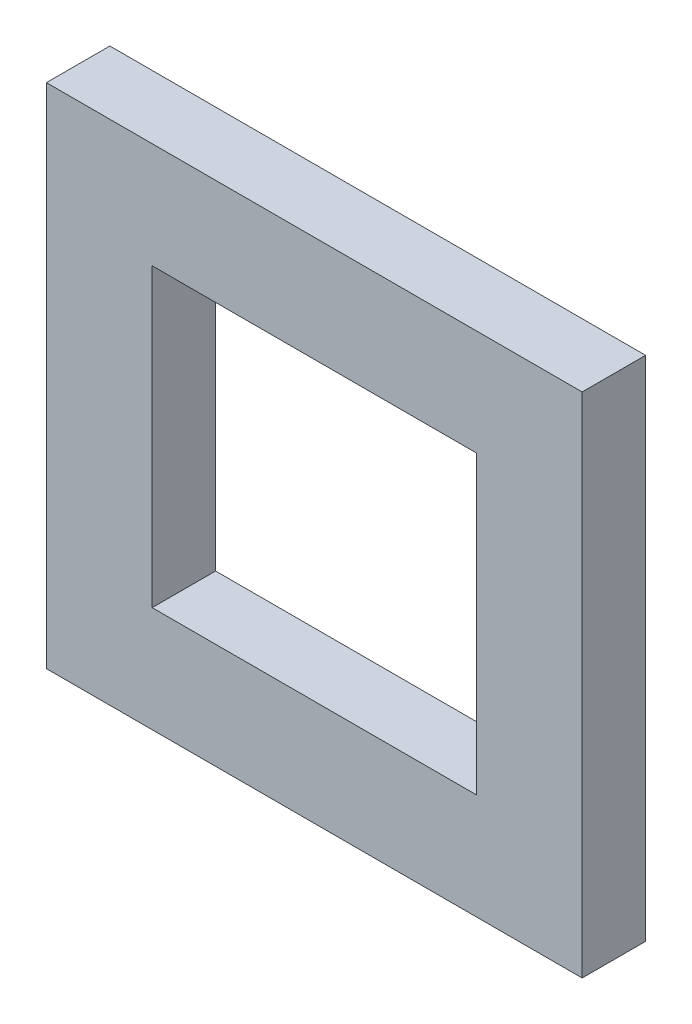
ISO-10303-21;
HEADER;
FILE_DESCRIPTION(('STEP AP214'),'2;1');
FILE_NAME('part.step','',(''),(''),'','','');
FILE_SCHEMA(('AUTOMOTIVE_DESIGN { 1 0 10303 214 1 1 1 1 }'));
ENDSEC;
DATA;
#1=APPLICATION_CONTEXT('core data for automotive mechanical design processes');
#2=APPLICATION_PROTOCOL_DEFINITION('international standard','automotive_design',2000,#1);
#3=PRODUCT_CONTEXT('',#1,'mechanical');
#4=PRODUCT('Part','Part','',(#3));
#5=PRODUCT_RELATED_PRODUCT_CATEGORY('part','',(#4));
#6=PRODUCT_DEFINITION_FORMATION('','',#4);
#7=PRODUCT_DEFINITION_CONTEXT('part definition',#1,'design');
#8=PRODUCT_DEFINITION('design','',#6,#7);
#9=PRODUCT_DEFINITION_SHAPE('','',#8);
#10=(LENGTH_UNIT() NAMED_UNIT(*) SI_UNIT(.MILLI.,.METRE.));
#11=(NAMED_UNIT(*) PLANE_ANGLE_UNIT() SI_UNIT($,.RADIAN.));
#12=(NAMED_UNIT(*) SI_UNIT($,.STERADIAN.) SOLID_ANGLE_UNIT());
#13=UNCERTAINTY_MEASURE_WITH_UNIT(LENGTH_MEASURE(1.E-05),#10,'distance_accuracy_value','');
#14=(GEOMETRIC_REPRESENTATION_CONTEXT(3) GLOBAL_UNCERTAINTY_ASSIGNED_CONTEXT((#13)) GLOBAL_UNIT_ASSIGNED_CONTEXT((#10,
#11,#12)) REPRESENTATION_CONTEXT('',''));
#15=CARTESIAN_POINT('',(0.,0.,0.));
#16=DIRECTION('',(0.,0.,1.));
#17=DIRECTION('',(1.,0.,0.));
#18=AXIS2_PLACEMENT_3D('',#15,#16,#17);
#19=CARTESIAN_POINT('',(0.,0.,28.575));
#20=DIRECTION('',(0.,0.,1.));
#21=DIRECTION('',(1.,0.,0.));
#22=AXIS2_PLACEMENT_3D('',#19,#20,#21);
#23=PLANE('',#22);
#24=DIRECTION('',(0.,-1.,0.));
#25=VECTOR('',#24,1.);
#26=CARTESIAN_POINT('',(-120.65,114.3,28.575));
#27=LINE('',#26,#25);
#28=CARTESIAN_POINT('',(-120.65,114.3,28.575));
#29=VERTEX_POINT('',#28);
#30=CARTESIAN_POINT('',(-120.65,-114.3,28.575));
#31=VERTEX_POINT('',#30);
#32=EDGE_CURVE('E137',#29,#31,#27,.T.);
#33=ORIENTED_EDGE('',*,*,#32,.T.);
#34=DIRECTION('',(1.,0.,0.));
#35=VECTOR('',#34,1.);
#36=CARTESIAN_POINT('',(-120.65,-114.3,28.575));
#37=LINE('',#36,#35);
#38=CARTESIAN_POINT('',(120.65,-114.3,28.575));
#39=VERTEX_POINT('',#38);
#40=EDGE_CURVE('E140',#31,#39,#37,.T.);
#41=ORIENTED_EDGE('',*,*,#40,.T.);
#42=DIRECTION('',(0.,1.,0.));
#43=VECTOR('',#42,1.);
#44=CARTESIAN_POINT('',(120.65,114.3,28.575));
#45=LINE('',#44,#43);
#46=CARTESIAN_POINT('',(120.65,114.3,28.575));
#47=VERTEX_POINT('',#46);
#48=EDGE_CURVE('E143',#39,#47,#45,.T.);
#49=ORIENTED_EDGE('',*,*,#48,.T.);
#50=DIRECTION('',(-1.,0.,0.));
#51=VECTOR('',#50,1.);
#52=CARTESIAN_POINT('',(-120.65,114.3,28.575));
#53=LINE('',#52,#51);
#54=EDGE_CURVE('E145',#47,#29,#53,.T.);
#55=ORIENTED_EDGE('',*,*,#54,.T.);
#56=EDGE_LOOP('',(#33,#41,#49,#55));
#57=FACE_BOUND('',#56,.T.);
#58=DIRECTION('',(0.,-1.,0.));
#59=VECTOR('',#58,1.);
#60=CARTESIAN_POINT('',(-73.025,66.675,28.575));
#61=LINE('',#60,#59);
#62=CARTESIAN_POINT('',(-73.025,66.675,28.575));
#63=VERTEX_POINT('',#62);
#64=CARTESIAN_POINT('',(-73.025,-66.675,28.575));
#65=VERTEX_POINT('',#64);
#66=EDGE_CURVE('E109',#63,#65,#61,.T.);
#67=ORIENTED_EDGE('',*,*,#66,.F.);
#68=DIRECTION('',(-1.,0.,0.));
#69=VECTOR('',#68,1.);
#70=CARTESIAN_POINT('',(-73.025,66.675,28.575));
#71=LINE('',#70,#69);
#72=CARTESIAN_POINT('',(73.025,66.675,28.575));
#73=VERTEX_POINT('',#72);
#74=EDGE_CURVE('E101',#73,#63,#71,.T.);
#75=ORIENTED_EDGE('',*,*,#74,.F.);
#76=DIRECTION('',(0.,1.,0.));
#77=VECTOR('',#76,1.);
#78=CARTESIAN_POINT('',(73.025,66.675,28.575));
#79=LINE('',#78,#77);
#80=CARTESIAN_POINT('',(73.025,-66.675,28.575));
#81=VERTEX_POINT('',#80);
#82=EDGE_CURVE('E123',#81,#73,#79,.T.);
#83=ORIENTED_EDGE('',*,*,#82,.F.);
#84=DIRECTION('',(1.,0.,0.));
#85=VECTOR('',#84,1.);
#86=CARTESIAN_POINT('',(-73.025,-66.675,28.575));
#87=LINE('',#86,#85);
#88=EDGE_CURVE('E121',#65,#81,#87,.T.);
#89=ORIENTED_EDGE('',*,*,#88,.F.);
#90=EDGE_LOOP('',(#67,#75,#83,#89));
#91=FACE_BOUND('',#90,.T.);
#92=ADVANCED_FACE('F36',(#57,#91),#23,.T.);
#93=CARTESIAN_POINT('',(0.,0.,0.));
#94=DIRECTION('',(0.,0.,1.));
#95=DIRECTION('',(1.,0.,0.));
#96=AXIS2_PLACEMENT_3D('',#93,#94,#95);
#97=PLANE('',#96);
#98=DIRECTION('',(0.,-1.,0.));
#99=VECTOR('',#98,1.);
#100=CARTESIAN_POINT('',(-120.65,114.3,0.));
#101=LINE('',#100,#99);
#102=CARTESIAN_POINT('',(-120.65,114.3,0.));
#103=VERTEX_POINT('',#102);
#104=CARTESIAN_POINT('',(-120.65,-114.3,0.));
#105=VERTEX_POINT('',#104);
#106=EDGE_CURVE('E117',#103,#105,#101,.T.);
#107=ORIENTED_EDGE('',*,*,#106,.F.);
#108=DIRECTION('',(-1.,0.,0.));
#109=VECTOR('',#108,1.);
#110=CARTESIAN_POINT('',(-120.65,114.3,0.));
#111=LINE('',#110,#109);
#112=CARTESIAN_POINT('',(120.65,114.3,0.));
#113=VERTEX_POINT('',#112);
#114=EDGE_CURVE('E141',#113,#103,#111,.T.);
#115=ORIENTED_EDGE('',*,*,#114,.F.);
#116=DIRECTION('',(0.,1.,0.));
#117=VECTOR('',#116,1.);
#118=CARTESIAN_POINT('',(120.65,114.3,0.));
#119=LINE('',#118,#117);
#120=CARTESIAN_POINT('',(120.65,-114.3,0.));
#121=VERTEX_POINT('',#120);
#122=EDGE_CURVE('E152',#121,#113,#119,.T.);
#123=ORIENTED_EDGE('',*,*,#122,.F.);
#124=DIRECTION('',(1.,0.,0.));
#125=VECTOR('',#124,1.);
#126=CARTESIAN_POINT('',(-120.65,-114.3,0.));
#127=LINE('',#126,#125);
#128=EDGE_CURVE('E150',#105,#121,#127,.T.);
#129=ORIENTED_EDGE('',*,*,#128,.F.);
#130=EDGE_LOOP('',(#107,#115,#123,#129));
#131=FACE_BOUND('',#130,.T.);
#132=DIRECTION('',(-1.,0.,0.));
#133=VECTOR('',#132,1.);
#134=CARTESIAN_POINT('',(-73.025,66.675,0.));
#135=LINE('',#134,#133);
#136=CARTESIAN_POINT('',(73.025,66.675,0.));
#137=VERTEX_POINT('',#136);
#138=CARTESIAN_POINT('',(-73.025,66.675,0.));
#139=VERTEX_POINT('',#138);
#140=EDGE_CURVE('E59',#137,#139,#135,.T.);
#141=ORIENTED_EDGE('',*,*,#140,.T.);
#142=DIRECTION('',(0.,-1.,0.));
#143=VECTOR('',#142,1.);
#144=CARTESIAN_POINT('',(-73.025,66.675,0.));
#145=LINE('',#144,#143);
#146=CARTESIAN_POINT('',(-73.025,-66.675,0.));
#147=VERTEX_POINT('',#146);
#148=EDGE_CURVE('E116',#139,#147,#145,.T.);
#149=ORIENTED_EDGE('',*,*,#148,.T.);
#150=DIRECTION('',(1.,0.,0.));
#151=VECTOR('',#150,1.);
#152=CARTESIAN_POINT('',(-73.025,-66.675,0.));
#153=LINE('',#152,#151);
#154=CARTESIAN_POINT('',(73.025,-66.675,0.));
#155=VERTEX_POINT('',#154);
#156=EDGE_CURVE('E129',#147,#155,#153,.T.);
#157=ORIENTED_EDGE('',*,*,#156,.T.);
#158=DIRECTION('',(0.,1.,0.));
#159=VECTOR('',#158,1.);
#160=CARTESIAN_POINT('',(73.025,66.675,0.));
#161=LINE('',#160,#159);
#162=EDGE_CURVE('E110',#155,#137,#161,.T.);
#163=ORIENTED_EDGE('',*,*,#162,.T.);
#164=EDGE_LOOP('',(#141,#149,#157,#163));
#165=FACE_BOUND('',#164,.T.);
#166=ADVANCED_FACE('F170',(#131,#165),#97,.F.);
#167=CARTESIAN_POINT('',(-120.65,114.3,28.575));
#168=DIRECTION('',(1.,0.,0.));
#169=DIRECTION('',(0.,1.,0.));
#170=AXIS2_PLACEMENT_3D('',#167,#168,#169);
#171=PLANE('',#170);
#172=ORIENTED_EDGE('',*,*,#106,.T.);
#173=DIRECTION('',(0.,0.,-1.));
#174=VECTOR('',#173,1.);
#175=CARTESIAN_POINT('',(-120.65,-114.3,28.575));
#176=LINE('',#175,#174);
#177=EDGE_CURVE('E11',#31,#105,#176,.T.);
#178=ORIENTED_EDGE('',*,*,#177,.F.);
#179=ORIENTED_EDGE('',*,*,#32,.F.);
#180=DIRECTION('',(0.,0.,-1.));
#181=VECTOR('',#180,1.);
#182=CARTESIAN_POINT('',(-120.65,114.3,28.575));
#183=LINE('',#182,#181);
#184=EDGE_CURVE('E147',#29,#103,#183,.T.);
#185=ORIENTED_EDGE('',*,*,#184,.T.);
#186=EDGE_LOOP('',(#172,#178,#179,#185));
#187=FACE_BOUND('',#186,.T.);
#188=ADVANCED_FACE('F38',(#187),#171,.F.);
#189=CARTESIAN_POINT('',(-120.65,-114.3,28.575));
#190=DIRECTION('',(0.,1.,0.));
#191=DIRECTION('',(0.,0.,1.));
#192=AXIS2_PLACEMENT_3D('',#189,#190,#191);
#193=PLANE('',#192);
#194=ORIENTED_EDGE('',*,*,#128,.T.);
#195=DIRECTION('',(0.,0.,-1.));
#196=VECTOR('',#195,1.);
#197=CARTESIAN_POINT('',(120.65,-114.3,28.575));
#198=LINE('',#197,#196);
#199=EDGE_CURVE('E44',#39,#121,#198,.T.);
#200=ORIENTED_EDGE('',*,*,#199,.F.);
#201=ORIENTED_EDGE('',*,*,#40,.F.);
#202=ORIENTED_EDGE('',*,*,#177,.T.);
#203=EDGE_LOOP('',(#194,#200,#201,#202));
#204=FACE_BOUND('',#203,.T.);
#205=ADVANCED_FACE('F180',(#204),#193,.F.);
#206=CARTESIAN_POINT('',(120.65,114.3,28.575));
#207=DIRECTION('',(-1.,0.,0.));
#208=DIRECTION('',(0.,-1.,0.));
#209=AXIS2_PLACEMENT_3D('',#206,#207,#208);
#210=PLANE('',#209);
#211=ORIENTED_EDGE('',*,*,#122,.T.);
#212=DIRECTION('',(0.,0.,-1.));
#213=VECTOR('',#212,1.);
#214=CARTESIAN_POINT('',(120.65,114.3,28.575));
#215=LINE('',#214,#213);
#216=EDGE_CURVE('E157',#47,#113,#215,.T.);
#217=ORIENTED_EDGE('',*,*,#216,.F.);
#218=ORIENTED_EDGE('',*,*,#48,.F.);
#219=ORIENTED_EDGE('',*,*,#199,.T.);
#220=EDGE_LOOP('',(#211,#217,#218,#219));
#221=FACE_BOUND('',#220,.T.);
#222=ADVANCED_FACE('F164',(#221),#210,.F.);
#223=CARTESIAN_POINT('',(-120.65,114.3,28.575));
#224=DIRECTION('',(0.,-1.,0.));
#225=DIRECTION('',(0.,0.,-1.));
#226=AXIS2_PLACEMENT_3D('',#223,#224,#225);
#227=PLANE('',#226);
#228=ORIENTED_EDGE('',*,*,#114,.T.);
#229=ORIENTED_EDGE('',*,*,#184,.F.);
#230=ORIENTED_EDGE('',*,*,#54,.F.);
#231=ORIENTED_EDGE('',*,*,#216,.T.);
#232=EDGE_LOOP('',(#228,#229,#230,#231));
#233=FACE_BOUND('',#232,.T.);
#234=ADVANCED_FACE('F174',(#233),#227,.F.);
#235=CARTESIAN_POINT('',(-73.025,66.675,28.575));
#236=DIRECTION('',(0.,-1.,0.));
#237=DIRECTION('',(0.,0.,-1.));
#238=AXIS2_PLACEMENT_3D('',#235,#236,#237);
#239=PLANE('',#238);
#240=ORIENTED_EDGE('',*,*,#140,.F.);
#241=DIRECTION('',(0.,0.,-1.));
#242=VECTOR('',#241,1.);
#243=CARTESIAN_POINT('',(73.025,66.675,28.575));
#244=LINE('',#243,#242);
#245=EDGE_CURVE('E105',#73,#137,#244,.T.);
#246=ORIENTED_EDGE('',*,*,#245,.F.);
#247=ORIENTED_EDGE('',*,*,#74,.T.);
#248=DIRECTION('',(0.,0.,-1.));
#249=VECTOR('',#248,1.);
#250=CARTESIAN_POINT('',(-73.025,66.675,28.575));
#251=LINE('',#250,#249);
#252=EDGE_CURVE('E104',#63,#139,#251,.T.);
#253=ORIENTED_EDGE('',*,*,#252,.T.);
#254=EDGE_LOOP('',(#240,#246,#247,#253));
#255=FACE_BOUND('',#254,.T.);
#256=ADVANCED_FACE('F103',(#255),#239,.T.);
#257=CARTESIAN_POINT('',(-73.025,66.675,28.575));
#258=DIRECTION('',(1.,0.,0.));
#259=DIRECTION('',(0.,0.,-1.));
#260=AXIS2_PLACEMENT_3D('',#257,#258,#259);
#261=PLANE('',#260);
#262=ORIENTED_EDGE('',*,*,#148,.F.);
#263=ORIENTED_EDGE('',*,*,#252,.F.);
#264=ORIENTED_EDGE('',*,*,#66,.T.);
#265=DIRECTION('',(0.,0.,-1.));
#266=VECTOR('',#265,1.);
#267=CARTESIAN_POINT('',(-73.025,-66.675,28.575));
#268=LINE('',#267,#266);
#269=EDGE_CURVE('E118',#65,#147,#268,.T.);
#270=ORIENTED_EDGE('',*,*,#269,.T.);
#271=EDGE_LOOP('',(#262,#263,#264,#270));
#272=FACE_BOUND('',#271,.T.);
#273=ADVANCED_FACE('F113',(#272),#261,.T.);
#274=CARTESIAN_POINT('',(-73.025,-66.675,28.575));
#275=DIRECTION('',(0.,1.,0.));
#276=DIRECTION('',(-1.,0.,0.));
#277=AXIS2_PLACEMENT_3D('',#274,#275,#276);
#278=PLANE('',#277);
#279=ORIENTED_EDGE('',*,*,#156,.F.);
#280=ORIENTED_EDGE('',*,*,#269,.F.);
#281=ORIENTED_EDGE('',*,*,#88,.T.);
#282=DIRECTION('',(0.,0.,-1.));
#283=VECTOR('',#282,1.);
#284=CARTESIAN_POINT('',(73.025,-66.675,28.575));
#285=LINE('',#284,#283);
#286=EDGE_CURVE('E51',#81,#155,#285,.T.);
#287=ORIENTED_EDGE('',*,*,#286,.T.);
#288=EDGE_LOOP('',(#279,#280,#281,#287));
#289=FACE_BOUND('',#288,.T.);
#290=ADVANCED_FACE('F203',(#289),#278,.T.);
#291=CARTESIAN_POINT('',(73.025,66.675,28.575));
#292=DIRECTION('',(-1.,0.,0.));
#293=DIRECTION('',(0.,-1.,0.));
#294=AXIS2_PLACEMENT_3D('',#291,#292,#293);
#295=PLANE('',#294);
#296=ORIENTED_EDGE('',*,*,#162,.F.);
#297=ORIENTED_EDGE('',*,*,#286,.F.);
#298=ORIENTED_EDGE('',*,*,#82,.T.);
#299=ORIENTED_EDGE('',*,*,#245,.T.);
#300=EDGE_LOOP('',(#296,#297,#298,#299));
#301=FACE_BOUND('',#300,.T.);
#302=ADVANCED_FACE('F207',(#301),#295,.T.);
#303=CLOSED_SHELL('',(#92,#166,#188,#205,#222,#234,#256,#273,#290,#302));
#304=MANIFOLD_SOLID_BREP('B2',#303);
#305=ADVANCED_BREP_SHAPE_REPRESENTATION('',(#18,#304),#14);
#306=SHAPE_DEFINITION_REPRESENTATION(#9,#305);
ENDSEC;
END-ISO-10303-21;
